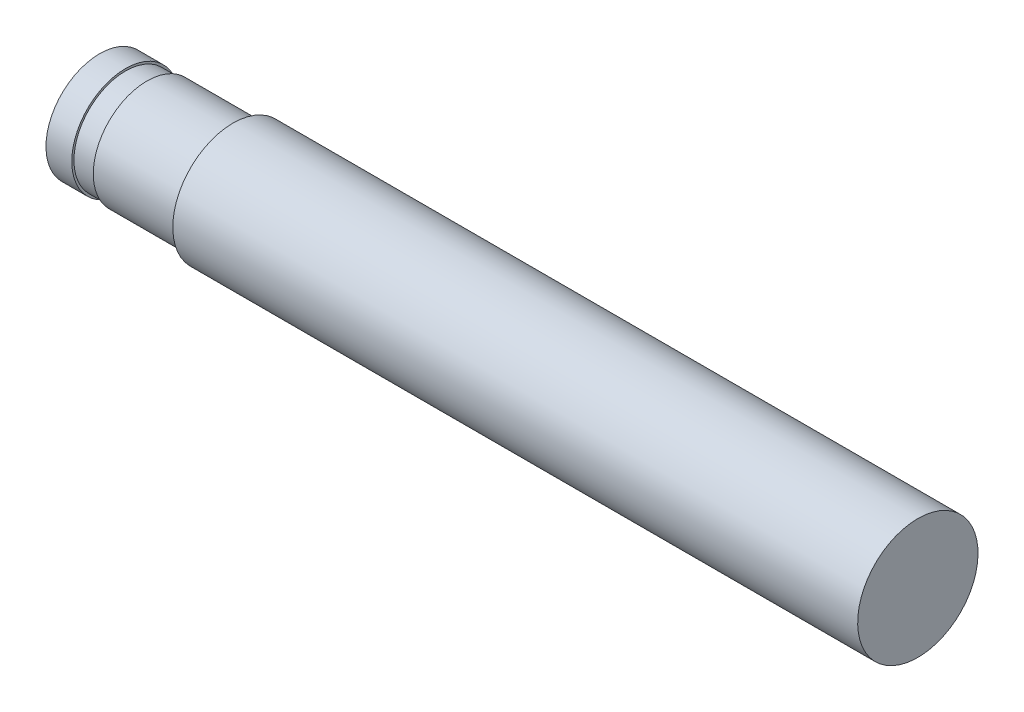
from build123d import *


with BuildPart() as part:
    # Sketch1 → Revolve1 (revolve)
    with BuildSketch(Plane.XY):
        Polygon((-571, 37.5), (-553, 37.5), (-553, 36), (-538, 36), (-538, 37.5), (-478, 37.5), (-478, 42), (0, 42), (0, 0), (-571, 0), align=None)
    revolve(axis=Axis((0, 0, 0), (-1, 0, 0)))


solid = part.part
